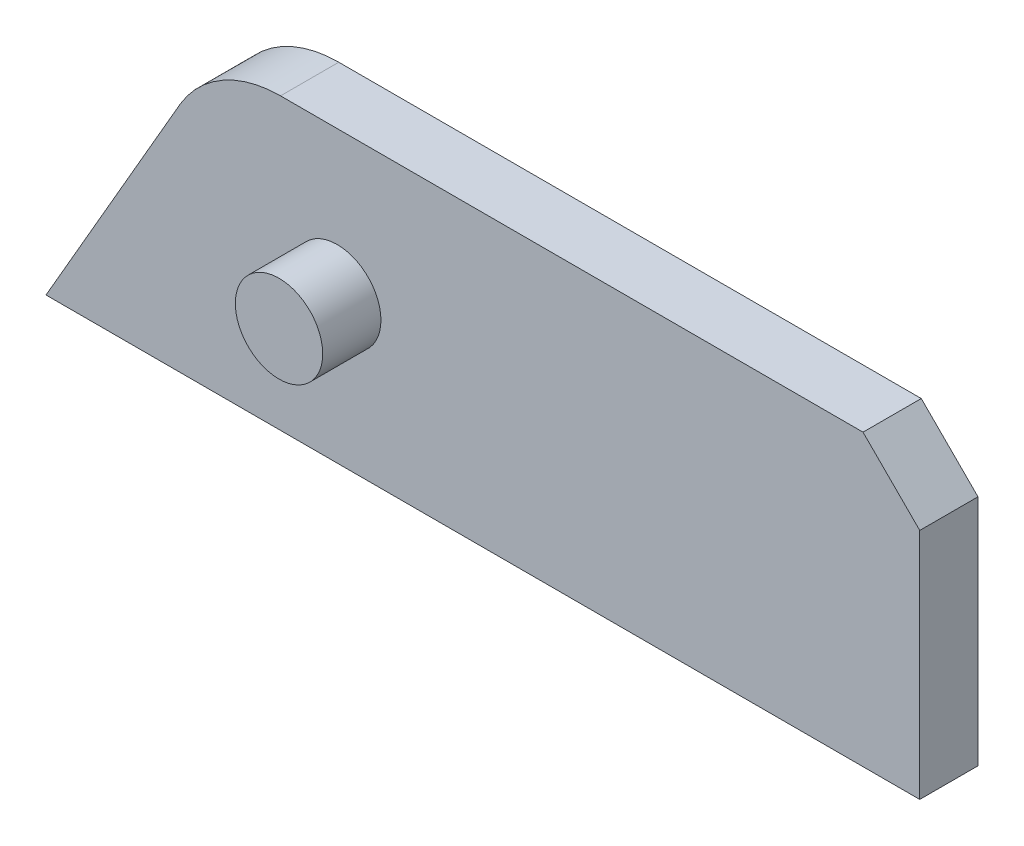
ISO-10303-21;
HEADER;
FILE_DESCRIPTION(('STEP AP214'),'2;1');
FILE_NAME('part.step','',(''),(''),'','','');
FILE_SCHEMA(('AUTOMOTIVE_DESIGN { 1 0 10303 214 1 1 1 1 }'));
ENDSEC;
DATA;
#1=APPLICATION_CONTEXT('core data for automotive mechanical design processes');
#2=APPLICATION_PROTOCOL_DEFINITION('international standard','automotive_design',2000,#1);
#3=PRODUCT_CONTEXT('',#1,'mechanical');
#4=PRODUCT('Part','Part','',(#3));
#5=PRODUCT_RELATED_PRODUCT_CATEGORY('part','',(#4));
#6=PRODUCT_DEFINITION_FORMATION('','',#4);
#7=PRODUCT_DEFINITION_CONTEXT('part definition',#1,'design');
#8=PRODUCT_DEFINITION('design','',#6,#7);
#9=PRODUCT_DEFINITION_SHAPE('','',#8);
#10=(LENGTH_UNIT() NAMED_UNIT(*) SI_UNIT(.MILLI.,.METRE.));
#11=(NAMED_UNIT(*) PLANE_ANGLE_UNIT() SI_UNIT($,.RADIAN.));
#12=(NAMED_UNIT(*) SI_UNIT($,.STERADIAN.) SOLID_ANGLE_UNIT());
#13=UNCERTAINTY_MEASURE_WITH_UNIT(LENGTH_MEASURE(1.E-05),#10,'distance_accuracy_value','');
#14=(GEOMETRIC_REPRESENTATION_CONTEXT(3) GLOBAL_UNCERTAINTY_ASSIGNED_CONTEXT((#13)) GLOBAL_UNIT_ASSIGNED_CONTEXT((#10,
#11,#12)) REPRESENTATION_CONTEXT('',''));
#15=CARTESIAN_POINT('',(0.,0.,0.));
#16=DIRECTION('',(0.,0.,1.));
#17=DIRECTION('',(1.,0.,0.));
#18=AXIS2_PLACEMENT_3D('',#15,#16,#17);
#19=CARTESIAN_POINT('',(-126.905989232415,40.,10.));
#20=DIRECTION('',(0.866025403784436,-0.500000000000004,0.));
#21=DIRECTION('',(0.500000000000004,0.866025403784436,0.));
#22=AXIS2_PLACEMENT_3D('',#19,#20,#21);
#23=PLANE('',#22);
#24=DIRECTION('',(-0.500000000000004,-0.866025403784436,0.));
#25=VECTOR('',#24,1.);
#26=CARTESIAN_POINT('',(-126.905989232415,40.,0.));
#27=LINE('',#26,#25);
#28=CARTESIAN_POINT('',(-126.905989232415,40.,0.));
#29=VERTEX_POINT('',#28);
#30=CARTESIAN_POINT('',(-150.,0.,0.));
#31=VERTEX_POINT('',#30);
#32=EDGE_CURVE('E128',#29,#31,#27,.T.);
#33=ORIENTED_EDGE('',*,*,#32,.T.);
#34=DIRECTION('',(0.,0.,-1.));
#35=VECTOR('',#34,1.);
#36=CARTESIAN_POINT('',(-150.,0.,10.));
#37=LINE('',#36,#35);
#38=CARTESIAN_POINT('',(-150.,0.,10.));
#39=VERTEX_POINT('',#38);
#40=EDGE_CURVE('E11',#39,#31,#37,.T.);
#41=ORIENTED_EDGE('',*,*,#40,.F.);
#42=DIRECTION('',(-0.500000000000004,-0.866025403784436,0.));
#43=VECTOR('',#42,1.);
#44=CARTESIAN_POINT('',(-126.905989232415,40.,10.));
#45=LINE('',#44,#43);
#46=CARTESIAN_POINT('',(-126.905989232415,40.,10.));
#47=VERTEX_POINT('',#46);
#48=EDGE_CURVE('E139',#47,#39,#45,.T.);
#49=ORIENTED_EDGE('',*,*,#48,.F.);
#50=DIRECTION('',(0.,0.,-1.));
#51=VECTOR('',#50,1.);
#52=CARTESIAN_POINT('',(-126.905989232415,40.,10.));
#53=LINE('',#52,#51);
#54=EDGE_CURVE('E124',#47,#29,#53,.T.);
#55=ORIENTED_EDGE('',*,*,#54,.T.);
#56=EDGE_LOOP('',(#33,#41,#49,#55));
#57=FACE_BOUND('',#56,.T.);
#58=ADVANCED_FACE('F44',(#57),#23,.F.);
#59=CARTESIAN_POINT('',(-150.,0.,10.));
#60=DIRECTION('',(0.,1.,0.));
#61=DIRECTION('',(0.,0.,1.));
#62=AXIS2_PLACEMENT_3D('',#59,#60,#61);
#63=PLANE('',#62);
#64=DIRECTION('',(1.,0.,0.));
#65=VECTOR('',#64,1.);
#66=CARTESIAN_POINT('',(-150.,0.,0.));
#67=LINE('',#66,#65);
#68=CARTESIAN_POINT('',(0.,0.,0.));
#69=VERTEX_POINT('',#68);
#70=EDGE_CURVE('E131',#31,#69,#67,.T.);
#71=ORIENTED_EDGE('',*,*,#70,.T.);
#72=DIRECTION('',(0.,0.,-1.));
#73=VECTOR('',#72,1.);
#74=CARTESIAN_POINT('',(0.,0.,10.));
#75=LINE('',#74,#73);
#76=CARTESIAN_POINT('',(0.,0.,10.));
#77=VERTEX_POINT('',#76);
#78=EDGE_CURVE('E52',#77,#69,#75,.T.);
#79=ORIENTED_EDGE('',*,*,#78,.F.);
#80=DIRECTION('',(1.,0.,0.));
#81=VECTOR('',#80,1.);
#82=CARTESIAN_POINT('',(-150.,0.,10.));
#83=LINE('',#82,#81);
#84=EDGE_CURVE('E97',#39,#77,#83,.T.);
#85=ORIENTED_EDGE('',*,*,#84,.F.);
#86=ORIENTED_EDGE('',*,*,#40,.T.);
#87=EDGE_LOOP('',(#71,#79,#85,#86));
#88=FACE_BOUND('',#87,.T.);
#89=ADVANCED_FACE('F165',(#88),#63,.F.);
#90=CARTESIAN_POINT('',(0.,0.,10.));
#91=DIRECTION('',(-1.,0.,0.));
#92=DIRECTION('',(0.,0.,1.));
#93=AXIS2_PLACEMENT_3D('',#90,#91,#92);
#94=PLANE('',#93);
#95=DIRECTION('',(0.,1.,0.));
#96=VECTOR('',#95,1.);
#97=CARTESIAN_POINT('',(0.,0.,0.));
#98=LINE('',#97,#96);
#99=CARTESIAN_POINT('',(0.,40.,0.));
#100=VERTEX_POINT('',#99);
#101=EDGE_CURVE('E134',#69,#100,#98,.T.);
#102=ORIENTED_EDGE('',*,*,#101,.T.);
#103=DIRECTION('',(0.,0.,-1.));
#104=VECTOR('',#103,1.);
#105=CARTESIAN_POINT('',(0.,40.,10.));
#106=LINE('',#105,#104);
#107=CARTESIAN_POINT('',(0.,40.,10.));
#108=VERTEX_POINT('',#107);
#109=EDGE_CURVE('E119',#108,#100,#106,.T.);
#110=ORIENTED_EDGE('',*,*,#109,.F.);
#111=DIRECTION('',(0.,1.,0.));
#112=VECTOR('',#111,1.);
#113=CARTESIAN_POINT('',(0.,0.,10.));
#114=LINE('',#113,#112);
#115=EDGE_CURVE('E110',#77,#108,#114,.T.);
#116=ORIENTED_EDGE('',*,*,#115,.F.);
#117=ORIENTED_EDGE('',*,*,#78,.T.);
#118=EDGE_LOOP('',(#102,#110,#116,#117));
#119=FACE_BOUND('',#118,.T.);
#120=ADVANCED_FACE('F145',(#119),#94,.F.);
#121=CARTESIAN_POINT('',(0.,40.,10.));
#122=DIRECTION('',(-0.707106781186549,-0.707106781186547,0.));
#123=DIRECTION('',(0.707106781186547,-0.707106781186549,0.));
#124=AXIS2_PLACEMENT_3D('',#121,#122,#123);
#125=PLANE('',#124);
#126=DIRECTION('',(-0.707106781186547,0.707106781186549,0.));
#127=VECTOR('',#126,1.);
#128=CARTESIAN_POINT('',(0.,40.,0.));
#129=LINE('',#128,#127);
#130=CARTESIAN_POINT('',(-9.73888406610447,49.7388840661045,0.));
#131=VERTEX_POINT('',#130);
#132=EDGE_CURVE('E118',#100,#131,#129,.T.);
#133=ORIENTED_EDGE('',*,*,#132,.T.);
#134=DIRECTION('',(0.,0.,-1.));
#135=VECTOR('',#134,1.);
#136=CARTESIAN_POINT('',(-9.73888406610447,49.7388840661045,10.));
#137=LINE('',#136,#135);
#138=CARTESIAN_POINT('',(-9.73888406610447,49.7388840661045,10.));
#139=VERTEX_POINT('',#138);
#140=EDGE_CURVE('E115',#139,#131,#137,.T.);
#141=ORIENTED_EDGE('',*,*,#140,.F.);
#142=DIRECTION('',(-0.707106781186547,0.707106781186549,0.));
#143=VECTOR('',#142,1.);
#144=CARTESIAN_POINT('',(0.,40.,10.));
#145=LINE('',#144,#143);
#146=EDGE_CURVE('E104',#108,#139,#145,.T.);
#147=ORIENTED_EDGE('',*,*,#146,.F.);
#148=ORIENTED_EDGE('',*,*,#109,.T.);
#149=EDGE_LOOP('',(#133,#141,#147,#148));
#150=FACE_BOUND('',#149,.T.);
#151=ADVANCED_FACE('F116',(#150),#125,.F.);
#152=CARTESIAN_POINT('',(-9.73888406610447,49.7388840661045,10.));
#153=DIRECTION('',(0.,-1.,0.));
#154=DIRECTION('',(1.,0.,0.));
#155=AXIS2_PLACEMENT_3D('',#152,#153,#154);
#156=PLANE('',#155);
#157=DIRECTION('',(-1.,0.,0.));
#158=VECTOR('',#157,1.);
#159=CARTESIAN_POINT('',(-9.73888406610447,49.7388840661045,0.));
#160=LINE('',#159,#158);
#161=CARTESIAN_POINT('',(-109.738884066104,49.7388840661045,0.));
#162=VERTEX_POINT('',#161);
#163=EDGE_CURVE('E83',#131,#162,#160,.T.);
#164=ORIENTED_EDGE('',*,*,#163,.T.);
#165=DIRECTION('',(0.,0.,-1.));
#166=VECTOR('',#165,1.);
#167=CARTESIAN_POINT('',(-109.738884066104,49.7388840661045,10.));
#168=LINE('',#167,#166);
#169=CARTESIAN_POINT('',(-109.738884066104,49.7388840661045,10.));
#170=VERTEX_POINT('',#169);
#171=EDGE_CURVE('E120',#170,#162,#168,.T.);
#172=ORIENTED_EDGE('',*,*,#171,.F.);
#173=DIRECTION('',(-1.,0.,0.));
#174=VECTOR('',#173,1.);
#175=CARTESIAN_POINT('',(-9.73888406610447,49.7388840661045,10.));
#176=LINE('',#175,#174);
#177=EDGE_CURVE('E108',#139,#170,#176,.T.);
#178=ORIENTED_EDGE('',*,*,#177,.F.);
#179=ORIENTED_EDGE('',*,*,#140,.T.);
#180=EDGE_LOOP('',(#164,#172,#178,#179));
#181=FACE_BOUND('',#180,.T.);
#182=ADVANCED_FACE('F122',(#181),#156,.F.);
#183=CARTESIAN_POINT('',(-109.738884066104,29.7388840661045,10.));
#184=DIRECTION('',(0.,0.,-1.));
#185=DIRECTION('',(-1.,0.,0.));
#186=AXIS2_PLACEMENT_3D('',#183,#184,#185);
#187=CYLINDRICAL_SURFACE('',#186,20.);
#188=CARTESIAN_POINT('',(-109.738884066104,29.7388840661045,0.));
#189=DIRECTION('',(0.,0.,1.));
#190=DIRECTION('',(1.,0.,0.));
#191=AXIS2_PLACEMENT_3D('',#188,#189,#190);
#192=CIRCLE('',#191,20.);
#193=EDGE_CURVE('E89',#162,#29,#192,.T.);
#194=ORIENTED_EDGE('',*,*,#193,.T.);
#195=ORIENTED_EDGE('',*,*,#54,.F.);
#196=CARTESIAN_POINT('',(-109.738884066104,29.7388840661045,10.));
#197=DIRECTION('',(0.,0.,1.));
#198=DIRECTION('',(1.,0.,0.));
#199=AXIS2_PLACEMENT_3D('',#196,#197,#198);
#200=CIRCLE('',#199,20.);
#201=EDGE_CURVE('E60',#170,#47,#200,.T.);
#202=ORIENTED_EDGE('',*,*,#201,.F.);
#203=ORIENTED_EDGE('',*,*,#171,.T.);
#204=EDGE_LOOP('',(#194,#195,#202,#203));
#205=FACE_BOUND('',#204,.T.);
#206=ADVANCED_FACE('F152',(#205),#187,.T.);
#207=CARTESIAN_POINT('',(-109.738884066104,29.7388840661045,10.));
#208=DIRECTION('',(0.,0.,1.));
#209=DIRECTION('',(1.,0.,0.));
#210=AXIS2_PLACEMENT_3D('',#207,#208,#209);
#211=PLANE('',#210);
#212=CARTESIAN_POINT('',(-100.,25.,10.));
#213=DIRECTION('',(0.,0.,1.));
#214=DIRECTION('',(1.,0.,0.));
#215=AXIS2_PLACEMENT_3D('',#212,#213,#214);
#216=CIRCLE('',#215,7.50000000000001);
#217=CARTESIAN_POINT('',(-92.5,25.,10.));
#218=VERTEX_POINT('',#217);
#219=EDGE_CURVE('E226',#218,#218,#216,.T.);
#220=ORIENTED_EDGE('',*,*,#219,.F.);
#221=EDGE_LOOP('',(#220));
#222=FACE_BOUND('',#221,.T.);
#223=ORIENTED_EDGE('',*,*,#48,.T.);
#224=ORIENTED_EDGE('',*,*,#84,.T.);
#225=ORIENTED_EDGE('',*,*,#115,.T.);
#226=ORIENTED_EDGE('',*,*,#146,.T.);
#227=ORIENTED_EDGE('',*,*,#177,.T.);
#228=ORIENTED_EDGE('',*,*,#201,.T.);
#229=EDGE_LOOP('',(#223,#224,#225,#226,#227,#228));
#230=FACE_BOUND('',#229,.T.);
#231=ADVANCED_FACE('F106',(#222,#230),#211,.T.);
#232=CARTESIAN_POINT('',(-109.738884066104,29.7388840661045,0.));
#233=DIRECTION('',(0.,0.,1.));
#234=DIRECTION('',(1.,0.,0.));
#235=AXIS2_PLACEMENT_3D('',#232,#233,#234);
#236=PLANE('',#235);
#237=ORIENTED_EDGE('',*,*,#32,.F.);
#238=ORIENTED_EDGE('',*,*,#193,.F.);
#239=ORIENTED_EDGE('',*,*,#163,.F.);
#240=ORIENTED_EDGE('',*,*,#132,.F.);
#241=ORIENTED_EDGE('',*,*,#101,.F.);
#242=ORIENTED_EDGE('',*,*,#70,.F.);
#243=EDGE_LOOP('',(#237,#238,#239,#240,#241,#242));
#244=FACE_BOUND('',#243,.T.);
#245=ADVANCED_FACE('F148',(#244),#236,.F.);
#246=CARTESIAN_POINT('',(-100.,25.,20.));
#247=DIRECTION('',(0.,0.,-1.));
#248=DIRECTION('',(-1.,0.,0.));
#249=AXIS2_PLACEMENT_3D('',#246,#247,#248);
#250=CYLINDRICAL_SURFACE('',#249,7.50000000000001);
#251=CARTESIAN_POINT('',(-100.,25.,20.));
#252=DIRECTION('',(0.,0.,1.));
#253=DIRECTION('',(1.,0.,0.));
#254=AXIS2_PLACEMENT_3D('',#251,#252,#253);
#255=CIRCLE('',#254,7.50000000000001);
#256=CARTESIAN_POINT('',(-92.5,25.,20.));
#257=VERTEX_POINT('',#256);
#258=EDGE_CURVE('E132',#257,#257,#255,.T.);
#259=ORIENTED_EDGE('',*,*,#258,.F.);
#260=EDGE_LOOP('',(#259));
#261=FACE_BOUND('',#260,.T.);
#262=ORIENTED_EDGE('',*,*,#219,.T.);
#263=EDGE_LOOP('',(#262));
#264=FACE_BOUND('',#263,.T.);
#265=ADVANCED_FACE('F204',(#261,#264),#250,.T.);
#266=CARTESIAN_POINT('',(-100.,25.,20.));
#267=DIRECTION('',(0.,0.,1.));
#268=DIRECTION('',(1.,0.,0.));
#269=AXIS2_PLACEMENT_3D('',#266,#267,#268);
#270=PLANE('',#269);
#271=ORIENTED_EDGE('',*,*,#258,.T.);
#272=EDGE_LOOP('',(#271));
#273=FACE_BOUND('',#272,.T.);
#274=ADVANCED_FACE('F211',(#273),#270,.T.);
#275=CLOSED_SHELL('',(#58,#89,#120,#151,#182,#206,#231,#245,#265,#274));
#276=MANIFOLD_SOLID_BREP('B2',#275);
#277=ADVANCED_BREP_SHAPE_REPRESENTATION('',(#18,#276),#14);
#278=SHAPE_DEFINITION_REPRESENTATION(#9,#277);
ENDSEC;
END-ISO-10303-21;
